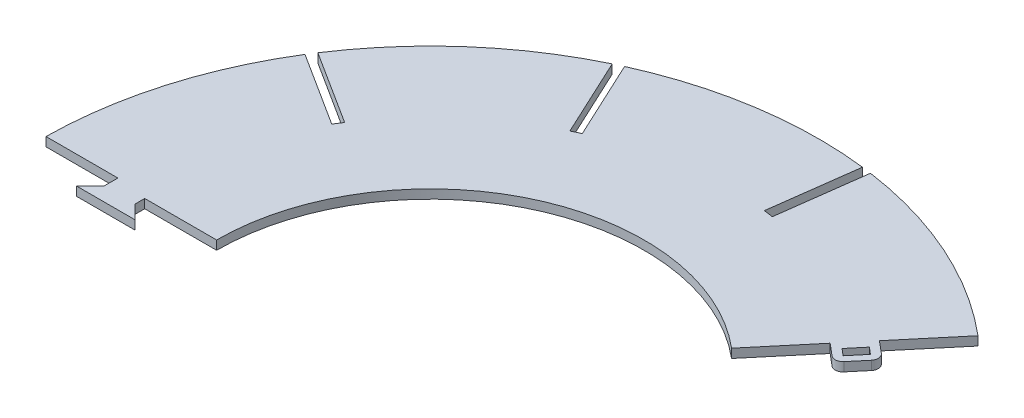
from build123d import *

# Parameters (mm, degrees)
SALIENTE_EXTRUIR1_DEPTH = 23


with BuildPart() as part:
    # Croquis3 → Saliente-Extruir1 (new body)
    with BuildSketch(Plane(origin=(0, 0, 0), x_dir=(1, 0, 0), z_dir=(0, 1, 0))):
        with BuildLine():
            Line((-1022.689766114, -413.040856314), (-837.750267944, -413.040856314))
            Line((-837.750267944, -413.040856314), (-837.750267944, -449.040856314))
            Line((-837.750267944, -449.040856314), (-872.750267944, -484.040856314))
            Line((-872.750267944, -484.040856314), (-722.750267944, -484.040856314))
            Line((-722.750267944, -484.040856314), (-757.750267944, -449.040856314))
            Line((-757.750267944, -449.040856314), (-757.750267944, -424.040856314))
            Line((-757.750267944, -424.040856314), (-572.750267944, -424.040856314))
            ThreePointArc((-572.750267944, -424.040856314), (-255.190311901, 74.428426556), (330.782917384, -2.716412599))
            Line((330.782917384, -2.716412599), (446.484687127, 135.171587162))
            Line((446.484687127, 135.171587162), (477.126464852, 109.460082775))
            ThreePointArc((477.126464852, 109.460082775), (491.725331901, 104.857077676), (505.303105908, 111.925219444))
            Line((505.303105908, 111.925219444), (537.442486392, 150.2274416))
            ThreePointArc((537.442486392, 150.2274416), (542.045491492, 164.826308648), (534.977349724, 178.404082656))
            Line((534.977349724, 178.404082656), (504.335571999, 204.115587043))
            Line((504.335571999, 204.115587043), (620.037341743, 342.003586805))
            ThreePointArc((620.037341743, 342.003586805), (385.481139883, 488.837622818), (119.663864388, 565.766304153))
            Line((119.663864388, 565.766304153), (90.291710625, 342.662646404))
            Line((90.291710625, 342.662646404), (66.497033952, 345.795275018))
            Line((66.497033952, 345.795275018), (95.869187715, 568.898932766))
            ThreePointArc((95.869187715, 568.898932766), (-174.873654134, 564.320654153), (-434.46240663, 487.273093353))
            Line((-434.46240663, 487.273093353), (-339.364462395, 283.334893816))
            Line((-339.364462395, 283.334893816), (-339.36112193, 283.327730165))
            Line((-339.36112193, 283.327730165), (-361.112508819, 273.184891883))
            Line((-361.112508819, 273.184891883), (-456.213793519, 477.130255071))
            ThreePointArc((-456.213793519, 477.130255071), (-682.096083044, 327.798951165), (-859.633392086, 123.340762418))
            Line((-859.633392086, 123.340762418), (-669.852684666, 2.437117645))
            Line((-669.852684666, 2.437117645), (-682.74120892, -17.808523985))
            Line((-682.74120892, -17.808523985), (-872.528582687, 103.099367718))
            ThreePointArc((-872.528582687, 103.099367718), (-982.939926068, -144.691933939), (-1022.689766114, -413.040856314))
        make_face()
        Polygon((523.270664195, 162.119012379), (491.13128371, 123.816790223), (473.512261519, 138.600905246), (505.651642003, 176.903127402), align=None, mode=Mode.SUBTRACT)
    extrude(amount=SALIENTE_EXTRUIR1_DEPTH)


solid = part.part
